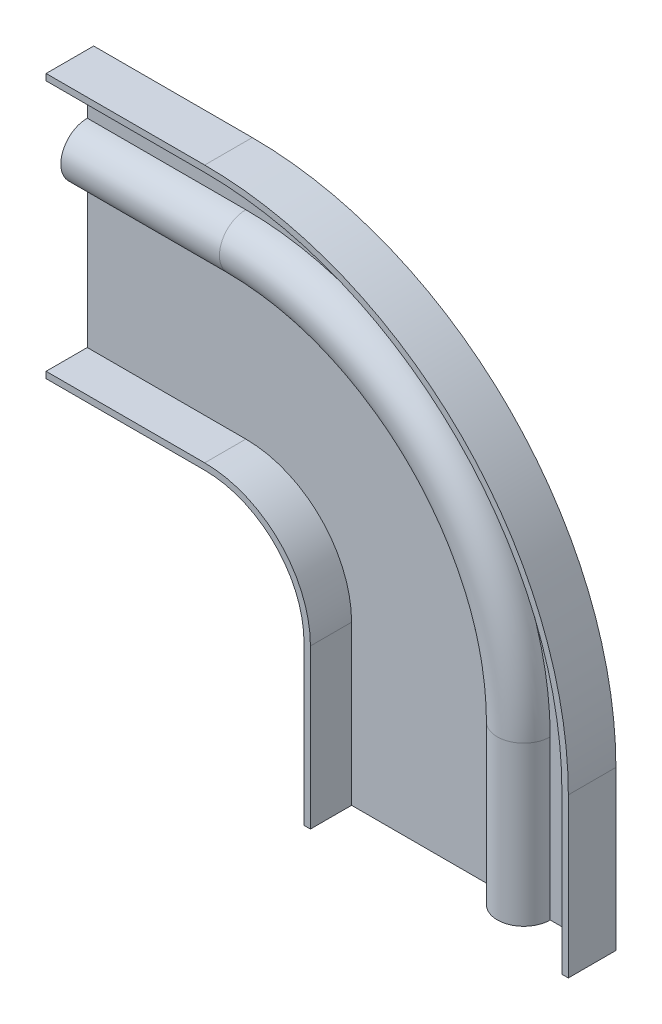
from build123d import *


with BuildPart() as part:
    # Sweep1: sweep along a path in Sketch1
    with BuildLine(Plane.XY) as sweep1_path:
        Line((-50, 50), (-20, 50))
        ThreePointArc((-20, 50), (-5.857864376, 44.142135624), (0, 30))
        Line((0, 30), (0, 0))
    # Sketch2 → Sweep1 (sweep)
    with BuildSketch(Plane(origin=(0, 0, 0), x_dir=(1, 0, 0), z_dir=(0, 1, 0))):
        with BuildLine():
            Line((-1.214, -1.214), (28.985915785, -1.214))
            ThreePointArc((28.985915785, -1.214), (32.572, -6.214), (36.158084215, -1.214))
            Line((36.158084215, -1.214), (48.786, -1.214))
            Line((48.786, -1.214), (48.786, -10.214))
            Line((48.786, -10.214), (47.572, -10.214))
            Line((47.572, -10.214), (47.572, -2.428))
            Line((47.572, -2.428), (37.572, -2.428))
            ThreePointArc((37.572, -2.428), (32.572, -7.428), (27.572, -2.428))
            Line((27.572, -2.428), (0, -2.428))
            Line((0, -2.428), (0, -10.214))
            Line((0, -10.214), (-1.214, -10.214))
            Line((-1.214, -10.214), (-1.214, -1.214))
        make_face()
    sweep(path=sweep1_path.line)


solid = part.part
